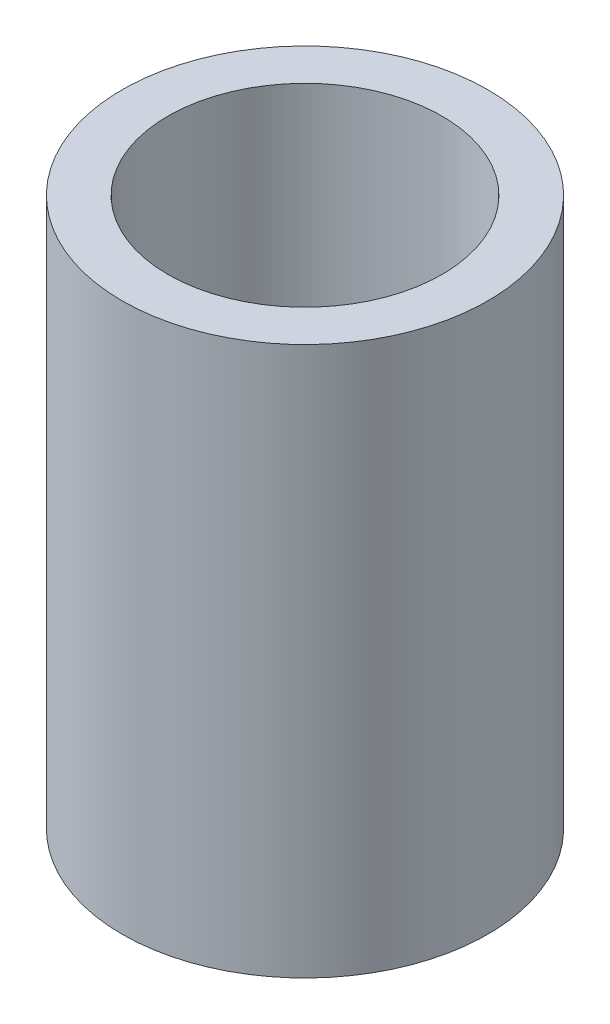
from build123d import *

# Parameters (mm, degrees)
SKETCH1_R           = 2
SKETCH1_R_2         = 1.5
BOSS_EXTRUDE1_DEPTH = 6


with BuildPart() as part:
    # Sketch1 → Boss-Extrude1 (new body)
    with BuildSketch(Plane(origin=(0, 0, 0), x_dir=(1, 0, 0), z_dir=(0, 1, 0))):
        with Locations(Location((0, 0, 0), (0, 0, 270))):
            Circle(SKETCH1_R)
        with Locations(Location((0, 0, 0), (0, 0, 270))):
            Circle(SKETCH1_R_2, mode=Mode.SUBTRACT)
    extrude(amount=BOSS_EXTRUDE1_DEPTH)


solid = part.part
